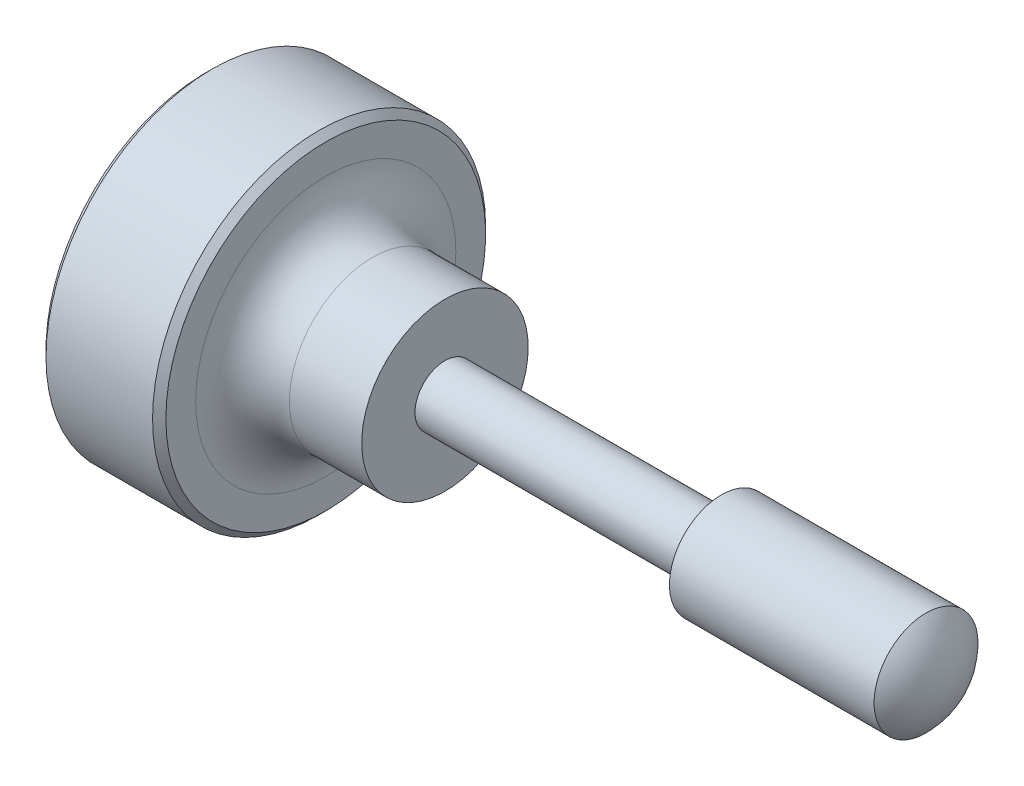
ISO-10303-21;
HEADER;
FILE_DESCRIPTION(('STEP AP214'),'2;1');
FILE_NAME('part.step','',(''),(''),'','','');
FILE_SCHEMA(('AUTOMOTIVE_DESIGN { 1 0 10303 214 1 1 1 1 }'));
ENDSEC;
DATA;
#1=APPLICATION_CONTEXT('core data for automotive mechanical design processes');
#2=APPLICATION_PROTOCOL_DEFINITION('international standard','automotive_design',2000,#1);
#3=PRODUCT_CONTEXT('',#1,'mechanical');
#4=PRODUCT('Part','Part','',(#3));
#5=PRODUCT_RELATED_PRODUCT_CATEGORY('part','',(#4));
#6=PRODUCT_DEFINITION_FORMATION('','',#4);
#7=PRODUCT_DEFINITION_CONTEXT('part definition',#1,'design');
#8=PRODUCT_DEFINITION('design','',#6,#7);
#9=PRODUCT_DEFINITION_SHAPE('','',#8);
#10=(LENGTH_UNIT() NAMED_UNIT(*) SI_UNIT(.MILLI.,.METRE.));
#11=(NAMED_UNIT(*) PLANE_ANGLE_UNIT() SI_UNIT($,.RADIAN.));
#12=(NAMED_UNIT(*) SI_UNIT($,.STERADIAN.) SOLID_ANGLE_UNIT());
#13=UNCERTAINTY_MEASURE_WITH_UNIT(LENGTH_MEASURE(1.E-05),#10,'distance_accuracy_value','');
#14=(GEOMETRIC_REPRESENTATION_CONTEXT(3) GLOBAL_UNCERTAINTY_ASSIGNED_CONTEXT((#13)) GLOBAL_UNIT_ASSIGNED_CONTEXT((#10,
#11,#12)) REPRESENTATION_CONTEXT('',''));
#15=CARTESIAN_POINT('',(0.,0.,0.));
#16=DIRECTION('',(0.,0.,1.));
#17=DIRECTION('',(1.,0.,0.));
#18=AXIS2_PLACEMENT_3D('',#15,#16,#17);
#19=CARTESIAN_POINT('',(11.3696749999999,-1.80477854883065E-13,0.));
#20=DIRECTION('',(0.396131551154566,0.90328407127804,0.164795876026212));
#21=DIRECTION('',(-0.876423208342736,0.318453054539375,0.36120632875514));
#22=AXIS2_PLACEMENT_3D('',#19,#20,#21);
#23=SPHERICAL_SURFACE('',#22,2.77812500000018);
#24=CARTESIAN_POINT('',(13.31719267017,0.,0.));
#25=DIRECTION('',(1.,0.,0.));
#26=DIRECTION('',(0.,0.,-1.));
#27=AXIS2_PLACEMENT_3D('',#24,#25,#26);
#28=CIRCLE('',#27,1.98119999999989);
#29=CARTESIAN_POINT('',(13.31719267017,0.,-1.98119999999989));
#30=VERTEX_POINT('',#29);
#31=EDGE_CURVE('E18',#30,#30,#28,.F.);
#32=ORIENTED_EDGE('',*,*,#31,.F.);
#33=EDGE_LOOP('',(#32));
#34=FACE_BOUND('',#33,.T.);
#35=ADVANCED_FACE('F14',(#34),#23,.T.);
#36=CARTESIAN_POINT('',(9.414496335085,0.,0.));
#37=DIRECTION('',(1.,0.,0.));
#38=DIRECTION('',(0.,0.,-1.));
#39=AXIS2_PLACEMENT_3D('',#36,#37,#38);
#40=CYLINDRICAL_SURFACE('',#39,1.98119999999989);
#41=ORIENTED_EDGE('',*,*,#31,.T.);
#42=EDGE_LOOP('',(#41));
#43=FACE_BOUND('',#42,.T.);
#44=CARTESIAN_POINT('',(5.51180000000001,0.,0.));
#45=DIRECTION('',(1.,0.,0.));
#46=DIRECTION('',(0.,0.,-1.));
#47=AXIS2_PLACEMENT_3D('',#44,#45,#46);
#48=CIRCLE('',#47,1.98119999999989);
#49=CARTESIAN_POINT('',(5.51180000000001,0.,-1.98119999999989));
#50=VERTEX_POINT('',#49);
#51=EDGE_CURVE('E45',#50,#50,#48,.F.);
#52=ORIENTED_EDGE('',*,*,#51,.F.);
#53=EDGE_LOOP('',(#52));
#54=FACE_BOUND('',#53,.T.);
#55=ADVANCED_FACE('F52',(#43,#54),#40,.T.);
#56=CARTESIAN_POINT('',(5.51179999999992,1.56209999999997,0.));
#57=DIRECTION('',(-1.,0.,0.));
#58=DIRECTION('',(0.,0.,1.));
#59=AXIS2_PLACEMENT_3D('',#56,#57,#58);
#60=PLANE('',#59);
#61=CARTESIAN_POINT('',(5.51179999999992,0.,0.));
#62=DIRECTION('',(1.,0.,0.));
#63=DIRECTION('',(0.,0.,-1.));
#64=AXIS2_PLACEMENT_3D('',#61,#62,#63);
#65=CIRCLE('',#64,1.14300000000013);
#66=CARTESIAN_POINT('',(5.51179999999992,0.,-1.14300000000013));
#67=VERTEX_POINT('',#66);
#68=EDGE_CURVE('E43',#67,#67,#65,.F.);
#69=ORIENTED_EDGE('',*,*,#68,.F.);
#70=EDGE_LOOP('',(#69));
#71=FACE_BOUND('',#70,.T.);
#72=ORIENTED_EDGE('',*,*,#51,.T.);
#73=EDGE_LOOP('',(#72));
#74=FACE_BOUND('',#73,.T.);
#75=ADVANCED_FACE('F60',(#71,#74),#60,.T.);
#76=CARTESIAN_POINT('',(0.241299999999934,0.,0.));
#77=DIRECTION('',(1.,0.,0.));
#78=DIRECTION('',(0.,0.,-1.));
#79=AXIS2_PLACEMENT_3D('',#76,#77,#78);
#80=CYLINDRICAL_SURFACE('',#79,1.14300000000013);
#81=ORIENTED_EDGE('',*,*,#68,.T.);
#82=EDGE_LOOP('',(#81));
#83=FACE_BOUND('',#82,.T.);
#84=CARTESIAN_POINT('',(-5.02920000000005,0.,0.));
#85=DIRECTION('',(1.,0.,0.));
#86=DIRECTION('',(0.,0.,-1.));
#87=AXIS2_PLACEMENT_3D('',#84,#85,#86);
#88=CIRCLE('',#87,1.14300000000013);
#89=CARTESIAN_POINT('',(-5.02920000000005,0.,-1.14300000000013));
#90=VERTEX_POINT('',#89);
#91=EDGE_CURVE('E40',#90,#90,#88,.F.);
#92=ORIENTED_EDGE('',*,*,#91,.F.);
#93=EDGE_LOOP('',(#92));
#94=FACE_BOUND('',#93,.T.);
#95=ADVANCED_FACE('F126',(#83,#94),#80,.T.);
#96=CARTESIAN_POINT('',(-5.02920000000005,2.15900000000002,0.));
#97=DIRECTION('',(1.,0.,0.));
#98=DIRECTION('',(0.,0.,-1.));
#99=AXIS2_PLACEMENT_3D('',#96,#97,#98);
#100=PLANE('',#99);
#101=CARTESIAN_POINT('',(-5.02919999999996,0.,0.));
#102=DIRECTION('',(1.,0.,0.));
#103=DIRECTION('',(0.,0.,-1.));
#104=AXIS2_PLACEMENT_3D('',#101,#102,#103);
#105=CIRCLE('',#104,3.17499999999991);
#106=CARTESIAN_POINT('',(-5.02919999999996,0.,-3.17499999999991));
#107=VERTEX_POINT('',#106);
#108=EDGE_CURVE('E36',#107,#107,#105,.F.);
#109=ORIENTED_EDGE('',*,*,#108,.F.);
#110=EDGE_LOOP('',(#109));
#111=FACE_BOUND('',#110,.T.);
#112=ORIENTED_EDGE('',*,*,#91,.T.);
#113=EDGE_LOOP('',(#112));
#114=FACE_BOUND('',#113,.T.);
#115=ADVANCED_FACE('F120',(#111,#114),#100,.T.);
#116=CARTESIAN_POINT('',(-6.4095312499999,0.,0.));
#117=DIRECTION('',(1.,0.,0.));
#118=DIRECTION('',(0.,0.,-1.));
#119=AXIS2_PLACEMENT_3D('',#116,#117,#118);
#120=CYLINDRICAL_SURFACE('',#119,3.17499999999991);
#121=ORIENTED_EDGE('',*,*,#108,.T.);
#122=EDGE_LOOP('',(#121));
#123=FACE_BOUND('',#122,.T.);
#124=CARTESIAN_POINT('',(-7.78986249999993,0.,0.));
#125=DIRECTION('',(1.,0.,0.));
#126=DIRECTION('',(0.,0.,-1.));
#127=AXIS2_PLACEMENT_3D('',#124,#125,#126);
#128=CIRCLE('',#127,3.175);
#129=CARTESIAN_POINT('',(-7.78986249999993,0.,-3.175));
#130=VERTEX_POINT('',#129);
#131=EDGE_CURVE('E39',#130,#130,#128,.F.);
#132=ORIENTED_EDGE('',*,*,#131,.F.);
#133=EDGE_LOOP('',(#132));
#134=FACE_BOUND('',#133,.T.);
#135=ADVANCED_FACE('F118',(#123,#134),#120,.T.);
#136=CARTESIAN_POINT('',(-7.78986250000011,0.,0.));
#137=DIRECTION('',(1.,0.,0.));
#138=DIRECTION('',(0.,0.,-1.));
#139=AXIS2_PLACEMENT_3D('',#136,#137,#138);
#140=TOROIDAL_SURFACE('',#139,4.9609375,1.7859375);
#141=CARTESIAN_POINT('',(-9.57580000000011,0.,0.));
#142=DIRECTION('',(1.,0.,0.));
#143=DIRECTION('',(0.,1.,0.));
#144=AXIS2_PLACEMENT_3D('',#141,#142,#143);
#145=CIRCLE('',#144,4.9609375);
#146=CARTESIAN_POINT('',(-9.57580000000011,4.9609375,0.));
#147=VERTEX_POINT('',#146);
#148=EDGE_CURVE('E35',#147,#147,#145,.F.);
#149=ORIENTED_EDGE('',*,*,#148,.F.);
#150=EDGE_LOOP('',(#149));
#151=FACE_BOUND('',#150,.T.);
#152=ORIENTED_EDGE('',*,*,#131,.T.);
#153=EDGE_LOOP('',(#152));
#154=FACE_BOUND('',#153,.T.);
#155=ADVANCED_FACE('F83',(#151,#154),#140,.F.);
#156=CARTESIAN_POINT('',(-9.57580000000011,5.65546875,0.));
#157=DIRECTION('',(1.,0.,0.));
#158=DIRECTION('',(0.,0.,-1.));
#159=AXIS2_PLACEMENT_3D('',#156,#157,#158);
#160=PLANE('',#159);
#161=CARTESIAN_POINT('',(-9.57580000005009,0.,0.));
#162=DIRECTION('',(-1.,0.,0.));
#163=DIRECTION('',(0.,0.,1.));
#164=AXIS2_PLACEMENT_3D('',#161,#162,#163);
#165=CIRCLE('',#164,6.09600000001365);
#166=CARTESIAN_POINT('',(-9.57580000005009,0.,6.09600000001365));
#167=VERTEX_POINT('',#166);
#168=EDGE_CURVE('E32',#167,#167,#165,.T.);
#169=ORIENTED_EDGE('',*,*,#168,.F.);
#170=EDGE_LOOP('',(#169));
#171=FACE_BOUND('',#170,.T.);
#172=ORIENTED_EDGE('',*,*,#148,.T.);
#173=EDGE_LOOP('',(#172));
#174=FACE_BOUND('',#173,.T.);
#175=ADVANCED_FACE('F78',(#171,#174),#160,.T.);
#176=CARTESIAN_POINT('',(-9.82979999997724,0.,0.));
#177=DIRECTION('',(-1.,0.,0.));
#178=DIRECTION('',(0.,0.,1.));
#179=AXIS2_PLACEMENT_3D('',#176,#177,#178);
#180=CONICAL_SURFACE('',#179,6.34999999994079,0.785398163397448);
#181=CARTESIAN_POINT('',(-9.82980000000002,0.,0.));
#182=DIRECTION('',(1.,0.,0.));
#183=DIRECTION('',(0.,0.,-1.));
#184=AXIS2_PLACEMENT_3D('',#181,#182,#183);
#185=CIRCLE('',#184,6.34999999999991);
#186=CARTESIAN_POINT('',(-9.82980000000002,0.,-6.34999999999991));
#187=VERTEX_POINT('',#186);
#188=EDGE_CURVE('E27',#187,#187,#185,.F.);
#189=ORIENTED_EDGE('',*,*,#188,.F.);
#190=EDGE_LOOP('',(#189));
#191=FACE_BOUND('',#190,.T.);
#192=ORIENTED_EDGE('',*,*,#168,.T.);
#193=EDGE_LOOP('',(#192));
#194=FACE_BOUND('',#193,.T.);
#195=ADVANCED_FACE('F74',(#191,#194),#180,.T.);
#196=CARTESIAN_POINT('',(-11.8618,0.,0.));
#197=DIRECTION('',(1.,0.,0.));
#198=DIRECTION('',(0.,0.,-1.));
#199=AXIS2_PLACEMENT_3D('',#196,#197,#198);
#200=CYLINDRICAL_SURFACE('',#199,6.34999999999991);
#201=ORIENTED_EDGE('',*,*,#188,.T.);
#202=EDGE_LOOP('',(#201));
#203=FACE_BOUND('',#202,.T.);
#204=CARTESIAN_POINT('',(-13.8938000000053,0.,0.));
#205=DIRECTION('',(1.,0.,0.));
#206=DIRECTION('',(0.,-1.,0.));
#207=AXIS2_PLACEMENT_3D('',#204,#205,#206);
#208=CIRCLE('',#207,6.34999999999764);
#209=CARTESIAN_POINT('',(-13.8938000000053,-6.34999999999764,0.));
#210=VERTEX_POINT('',#209);
#211=EDGE_CURVE('E22',#210,#210,#208,.F.);
#212=ORIENTED_EDGE('',*,*,#211,.F.);
#213=EDGE_LOOP('',(#212));
#214=FACE_BOUND('',#213,.T.);
#215=ADVANCED_FACE('F68',(#203,#214),#200,.T.);
#216=CARTESIAN_POINT('',(-13.893800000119,0.,0.));
#217=DIRECTION('',(1.,0.,0.));
#218=DIRECTION('',(0.,0.,-1.));
#219=AXIS2_PLACEMENT_3D('',#216,#217,#218);
#220=CONICAL_SURFACE('',#219,6.34999999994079,0.785398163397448);
#221=CARTESIAN_POINT('',(-14.1477999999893,0.,0.));
#222=DIRECTION('',(1.,0.,0.));
#223=DIRECTION('',(0.,0.,-1.));
#224=AXIS2_PLACEMENT_3D('',#221,#222,#223);
#225=CIRCLE('',#224,6.09600000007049);
#226=CARTESIAN_POINT('',(-14.1477999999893,0.,-6.09600000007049));
#227=VERTEX_POINT('',#226);
#228=EDGE_CURVE('E10',#227,#227,#225,.F.);
#229=ORIENTED_EDGE('',*,*,#228,.F.);
#230=EDGE_LOOP('',(#229));
#231=FACE_BOUND('',#230,.T.);
#232=ORIENTED_EDGE('',*,*,#211,.T.);
#233=EDGE_LOOP('',(#232));
#234=FACE_BOUND('',#233,.T.);
#235=ADVANCED_FACE('F63',(#231,#234),#220,.T.);
#236=CARTESIAN_POINT('',(-14.1478000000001,3.17499999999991,0.));
#237=DIRECTION('',(-1.,0.,0.));
#238=DIRECTION('',(0.,0.,1.));
#239=AXIS2_PLACEMENT_3D('',#236,#237,#238);
#240=PLANE('',#239);
#241=ORIENTED_EDGE('',*,*,#228,.T.);
#242=EDGE_LOOP('',(#241));
#243=FACE_BOUND('',#242,.T.);
#244=ADVANCED_FACE('F61',(#243),#240,.T.);
#245=CLOSED_SHELL('',(#35,#55,#75,#95,#115,#135,#155,#175,#195,#215,#235,#244));
#246=MANIFOLD_SOLID_BREP('B1',#245);
#247=ADVANCED_BREP_SHAPE_REPRESENTATION('',(#18,#246),#14);
#248=SHAPE_DEFINITION_REPRESENTATION(#9,#247);
ENDSEC;
END-ISO-10303-21;
